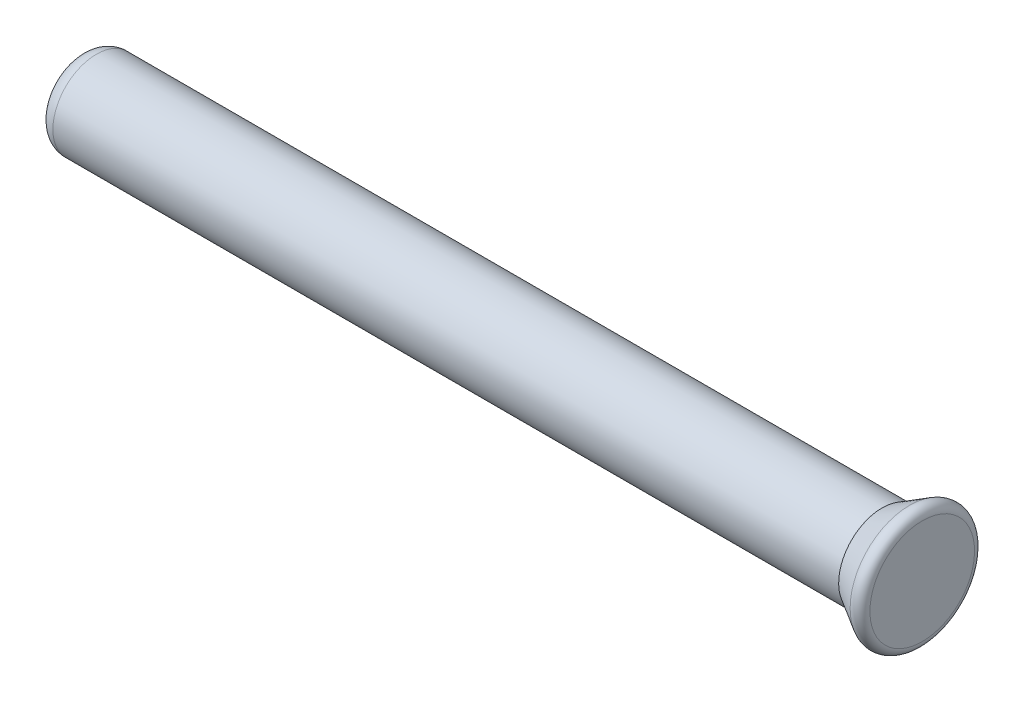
from build123d import *

# Parameters (mm, degrees)
CONG_1_R = 0.25
CONG_2_R = 0.125


with BuildPart() as part:
    # Esquisse1 → R_volution1 (revolve)
    with BuildSketch(Plane.XY):
        Polygon((-12.6, 0.65), (-0.6, 0.65), (0, 1), (0, 0), (-12.6, 0), align=None)
    revolve(axis=Axis((0, 0, 0), (-1, 0, 0)))

    # Cong_1
    cong_1_edges = [part.edges().sort_by_distance(p)[0] for p in [
        (-12.6, -0.65, 0),
    ]]
    fillet(cong_1_edges, radius=CONG_1_R)

    # Cong_2
    cong_2_edges = [part.edges().sort_by_distance(p)[0] for p in [
        (0, -1, 0),
    ]]
    fillet(cong_2_edges, radius=CONG_2_R)


solid = part.part
